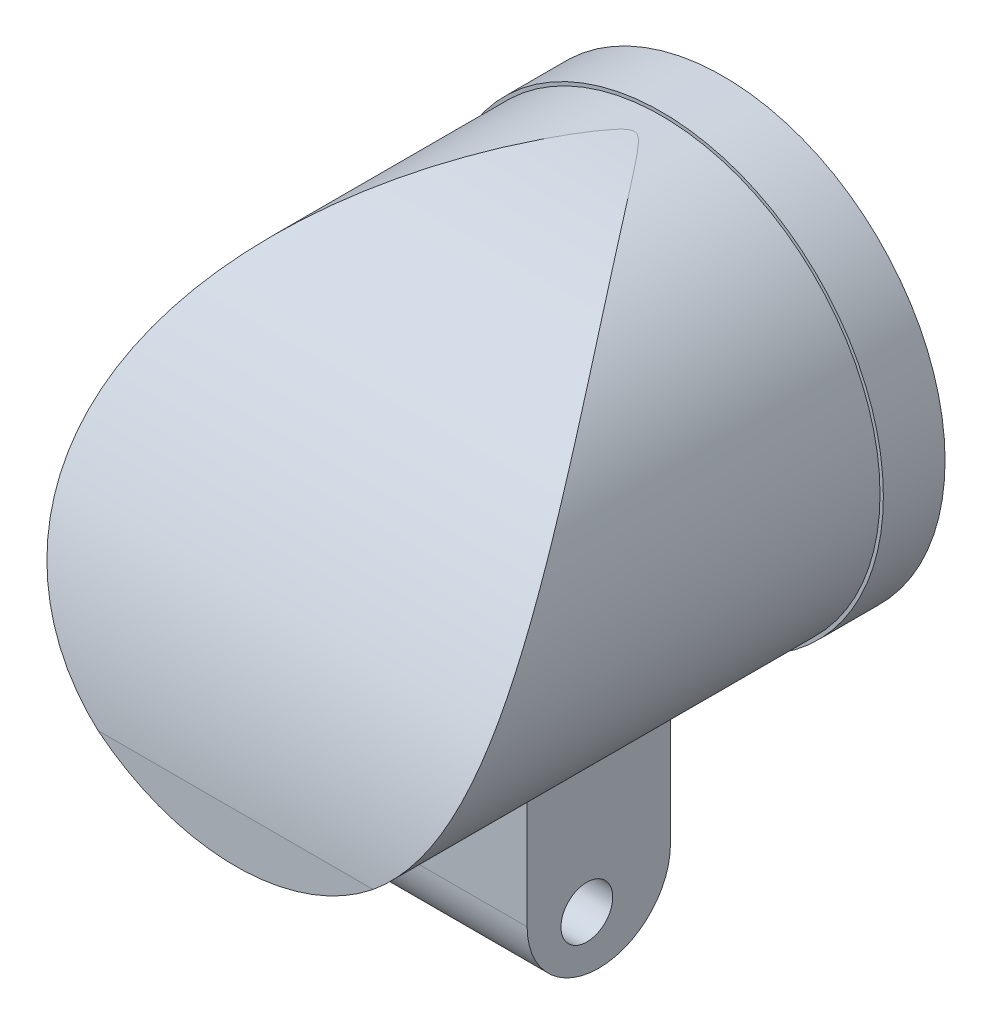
ISO-10303-21;
HEADER;
FILE_DESCRIPTION(('STEP AP214'),'2;1');
FILE_NAME('part.step','',(''),(''),'','','');
FILE_SCHEMA(('AUTOMOTIVE_DESIGN { 1 0 10303 214 1 1 1 1 }'));
ENDSEC;
DATA;
#1=APPLICATION_CONTEXT('core data for automotive mechanical design processes');
#2=APPLICATION_PROTOCOL_DEFINITION('international standard','automotive_design',2000,#1);
#3=PRODUCT_CONTEXT('',#1,'mechanical');
#4=PRODUCT('Part','Part','',(#3));
#5=PRODUCT_RELATED_PRODUCT_CATEGORY('part','',(#4));
#6=PRODUCT_DEFINITION_FORMATION('','',#4);
#7=PRODUCT_DEFINITION_CONTEXT('part definition',#1,'design');
#8=PRODUCT_DEFINITION('design','',#6,#7);
#9=PRODUCT_DEFINITION_SHAPE('','',#8);
#10=(LENGTH_UNIT() NAMED_UNIT(*) SI_UNIT(.MILLI.,.METRE.));
#11=(NAMED_UNIT(*) PLANE_ANGLE_UNIT() SI_UNIT($,.RADIAN.));
#12=(NAMED_UNIT(*) SI_UNIT($,.STERADIAN.) SOLID_ANGLE_UNIT());
#13=UNCERTAINTY_MEASURE_WITH_UNIT(LENGTH_MEASURE(1.E-05),#10,'distance_accuracy_value','');
#14=(GEOMETRIC_REPRESENTATION_CONTEXT(3) GLOBAL_UNCERTAINTY_ASSIGNED_CONTEXT((#13)) GLOBAL_UNIT_ASSIGNED_CONTEXT((#10,
#11,#12)) REPRESENTATION_CONTEXT('',''));
#15=CARTESIAN_POINT('',(0.,0.,0.));
#16=DIRECTION('',(0.,0.,1.));
#17=DIRECTION('',(1.,0.,0.));
#18=AXIS2_PLACEMENT_3D('',#15,#16,#17);
#19=CARTESIAN_POINT('',(12.319,-24.765,37.338));
#20=DIRECTION('',(0.,0.,1.));
#21=DIRECTION('',(1.,0.,0.));
#22=AXIS2_PLACEMENT_3D('',#19,#20,#21);
#23=PLANE('',#22);
#24=DIRECTION('',(0.,-1.,0.));
#25=VECTOR('',#24,1.);
#26=CARTESIAN_POINT('',(-12.319,-24.765,37.338));
#27=LINE('',#26,#25);
#28=CARTESIAN_POINT('',(-12.319,-24.765,37.338));
#29=VERTEX_POINT('',#28);
#30=CARTESIAN_POINT('',(-12.319,-40.8800612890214,37.338));
#31=VERTEX_POINT('',#30);
#32=EDGE_CURVE('E12',#29,#31,#27,.T.);
#33=ORIENTED_EDGE('',*,*,#32,.T.);
#34=DIRECTION('',(-1.,0.,0.));
#35=VECTOR('',#34,1.);
#36=CARTESIAN_POINT('',(28.321,-40.8800612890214,37.338));
#37=LINE('',#36,#35);
#38=CARTESIAN_POINT('',(12.319,-40.8800612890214,37.338));
#39=VERTEX_POINT('',#38);
#40=EDGE_CURVE('E82',#39,#31,#37,.T.);
#41=ORIENTED_EDGE('',*,*,#40,.F.);
#42=DIRECTION('',(0.,-1.,0.));
#43=VECTOR('',#42,1.);
#44=CARTESIAN_POINT('',(12.319,-24.765,37.338));
#45=LINE('',#44,#43);
#46=CARTESIAN_POINT('',(12.319,-24.765,37.338));
#47=VERTEX_POINT('',#46);
#48=EDGE_CURVE('E51',#47,#39,#45,.T.);
#49=ORIENTED_EDGE('',*,*,#48,.F.);
#50=DIRECTION('',(-1.,0.,0.));
#51=VECTOR('',#50,1.);
#52=CARTESIAN_POINT('',(12.319,-24.765,37.338));
#53=LINE('',#52,#51);
#54=EDGE_CURVE('E96',#47,#29,#53,.T.);
#55=ORIENTED_EDGE('',*,*,#54,.T.);
#56=EDGE_LOOP('',(#33,#41,#49,#55));
#57=FACE_BOUND('',#56,.T.);
#58=ADVANCED_FACE('F42',(#57),#23,.T.);
#59=CARTESIAN_POINT('',(-12.319,-24.765,37.338));
#60=DIRECTION('',(-1.,0.,0.));
#61=DIRECTION('',(0.,0.,1.));
#62=AXIS2_PLACEMENT_3D('',#59,#60,#61);
#63=PLANE('',#62);
#64=CARTESIAN_POINT('',(-12.319,-40.8800612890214,28.194));
#65=DIRECTION('',(1.,0.,0.));
#66=DIRECTION('',(0.,0.,-1.));
#67=AXIS2_PLACEMENT_3D('',#64,#65,#66);
#68=CIRCLE('',#67,9.144);
#69=CARTESIAN_POINT('',(-12.319,-40.8800612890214,19.05));
#70=VERTEX_POINT('',#69);
#71=EDGE_CURVE('E59',#31,#70,#68,.T.);
#72=ORIENTED_EDGE('',*,*,#71,.F.);
#73=ORIENTED_EDGE('',*,*,#32,.F.);
#74=DIRECTION('',(0.,0.,-1.));
#75=VECTOR('',#74,1.);
#76=CARTESIAN_POINT('',(-12.319,-24.765,37.338));
#77=LINE('',#76,#75);
#78=CARTESIAN_POINT('',(-12.319,-24.765,19.05));
#79=VERTEX_POINT('',#78);
#80=EDGE_CURVE('E117',#29,#79,#77,.T.);
#81=ORIENTED_EDGE('',*,*,#80,.T.);
#82=DIRECTION('',(0.,-1.,0.));
#83=VECTOR('',#82,1.);
#84=CARTESIAN_POINT('',(-12.319,-24.765,19.05));
#85=LINE('',#84,#83);
#86=EDGE_CURVE('E92',#79,#70,#85,.T.);
#87=ORIENTED_EDGE('',*,*,#86,.T.);
#88=EDGE_LOOP('',(#72,#73,#81,#87));
#89=FACE_BOUND('',#88,.T.);
#90=CARTESIAN_POINT('',(-12.319,-43.053,29.718));
#91=DIRECTION('',(-1.,0.,0.));
#92=DIRECTION('',(0.,0.,1.));
#93=AXIS2_PLACEMENT_3D('',#90,#91,#92);
#94=CIRCLE('',#93,3.302);
#95=CARTESIAN_POINT('',(-12.319,-43.053,33.02));
#96=VERTEX_POINT('',#95);
#97=EDGE_CURVE('E120',#96,#96,#94,.T.);
#98=ORIENTED_EDGE('',*,*,#97,.F.);
#99=EDGE_LOOP('',(#98));
#100=FACE_BOUND('',#99,.T.);
#101=ADVANCED_FACE('F44',(#89,#100),#63,.T.);
#102=CARTESIAN_POINT('',(12.319,-24.765,37.338));
#103=DIRECTION('',(1.,0.,0.));
#104=DIRECTION('',(0.,0.,-1.));
#105=AXIS2_PLACEMENT_3D('',#102,#103,#104);
#106=PLANE('',#105);
#107=CARTESIAN_POINT('',(12.319,-40.8800612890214,28.194));
#108=DIRECTION('',(1.,0.,0.));
#109=DIRECTION('',(0.,0.,-1.));
#110=AXIS2_PLACEMENT_3D('',#107,#108,#109);
#111=CIRCLE('',#110,9.144);
#112=CARTESIAN_POINT('',(12.319,-40.8800612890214,19.05));
#113=VERTEX_POINT('',#112);
#114=EDGE_CURVE('E85',#113,#39,#111,.F.);
#115=ORIENTED_EDGE('',*,*,#114,.F.);
#116=DIRECTION('',(0.,-1.,0.));
#117=VECTOR('',#116,1.);
#118=CARTESIAN_POINT('',(12.319,-24.765,19.05));
#119=LINE('',#118,#117);
#120=CARTESIAN_POINT('',(12.319,-24.765,19.05));
#121=VERTEX_POINT('',#120);
#122=EDGE_CURVE('E102',#121,#113,#119,.T.);
#123=ORIENTED_EDGE('',*,*,#122,.F.);
#124=DIRECTION('',(0.,0.,1.));
#125=VECTOR('',#124,1.);
#126=CARTESIAN_POINT('',(12.319,-24.765,37.338));
#127=LINE('',#126,#125);
#128=EDGE_CURVE('E100',#121,#47,#127,.T.);
#129=ORIENTED_EDGE('',*,*,#128,.T.);
#130=ORIENTED_EDGE('',*,*,#48,.T.);
#131=EDGE_LOOP('',(#115,#123,#129,#130));
#132=FACE_BOUND('',#131,.T.);
#133=CARTESIAN_POINT('',(12.319,-43.053,29.718));
#134=DIRECTION('',(1.,0.,0.));
#135=DIRECTION('',(0.,0.,-1.));
#136=AXIS2_PLACEMENT_3D('',#133,#134,#135);
#137=CIRCLE('',#136,3.302);
#138=CARTESIAN_POINT('',(12.319,-43.053,26.416));
#139=VERTEX_POINT('',#138);
#140=EDGE_CURVE('E46',#139,#139,#137,.T.);
#141=ORIENTED_EDGE('',*,*,#140,.F.);
#142=EDGE_LOOP('',(#141));
#143=FACE_BOUND('',#142,.T.);
#144=ADVANCED_FACE('F114',(#132,#143),#106,.T.);
#145=CARTESIAN_POINT('',(12.319,-24.765,19.05));
#146=DIRECTION('',(0.,0.,-1.));
#147=DIRECTION('',(-1.,0.,0.));
#148=AXIS2_PLACEMENT_3D('',#145,#146,#147);
#149=PLANE('',#148);
#150=DIRECTION('',(-1.,0.,0.));
#151=VECTOR('',#150,1.);
#152=CARTESIAN_POINT('',(28.321,-40.8800612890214,19.05));
#153=LINE('',#152,#151);
#154=EDGE_CURVE('E88',#113,#70,#153,.T.);
#155=ORIENTED_EDGE('',*,*,#154,.T.);
#156=ORIENTED_EDGE('',*,*,#86,.F.);
#157=DIRECTION('',(1.,0.,0.));
#158=VECTOR('',#157,1.);
#159=CARTESIAN_POINT('',(12.319,-24.765,19.05));
#160=LINE('',#159,#158);
#161=EDGE_CURVE('E103',#79,#121,#160,.T.);
#162=ORIENTED_EDGE('',*,*,#161,.T.);
#163=ORIENTED_EDGE('',*,*,#122,.T.);
#164=EDGE_LOOP('',(#155,#156,#162,#163));
#165=FACE_BOUND('',#164,.T.);
#166=ADVANCED_FACE('F111',(#165),#149,.T.);
#167=CARTESIAN_POINT('',(0.,-24.765,0.));
#168=DIRECTION('',(0.,1.,0.));
#169=DIRECTION('',(0.,0.,1.));
#170=AXIS2_PLACEMENT_3D('',#167,#168,#169);
#171=PLANE('',#170);
#172=ORIENTED_EDGE('',*,*,#80,.F.);
#173=ORIENTED_EDGE('',*,*,#54,.F.);
#174=ORIENTED_EDGE('',*,*,#128,.F.);
#175=ORIENTED_EDGE('',*,*,#161,.F.);
#176=EDGE_LOOP('',(#172,#173,#174,#175));
#177=FACE_BOUND('',#176,.T.);
#178=ADVANCED_FACE('F116',(#177),#171,.T.);
#179=CARTESIAN_POINT('',(28.321,-43.053,29.718));
#180=DIRECTION('',(-1.,0.,0.));
#181=DIRECTION('',(0.,0.,1.));
#182=AXIS2_PLACEMENT_3D('',#179,#180,#181);
#183=CYLINDRICAL_SURFACE('',#182,3.302);
#184=ORIENTED_EDGE('',*,*,#140,.T.);
#185=EDGE_LOOP('',(#184));
#186=FACE_BOUND('',#185,.T.);
#187=ORIENTED_EDGE('',*,*,#97,.T.);
#188=EDGE_LOOP('',(#187));
#189=FACE_BOUND('',#188,.T.);
#190=ADVANCED_FACE('F127',(#186,#189),#183,.F.);
#191=CARTESIAN_POINT('',(28.321,-40.8800612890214,28.194));
#192=DIRECTION('',(-1.,0.,0.));
#193=DIRECTION('',(0.,0.,1.));
#194=AXIS2_PLACEMENT_3D('',#191,#192,#193);
#195=CYLINDRICAL_SURFACE('',#194,9.144);
#196=ORIENTED_EDGE('',*,*,#114,.T.);
#197=ORIENTED_EDGE('',*,*,#40,.T.);
#198=ORIENTED_EDGE('',*,*,#71,.T.);
#199=ORIENTED_EDGE('',*,*,#154,.F.);
#200=EDGE_LOOP('',(#196,#197,#198,#199));
#201=FACE_BOUND('',#200,.T.);
#202=ADVANCED_FACE('F83',(#201),#195,.T.);
#203=CLOSED_SHELL('',(#58,#101,#144,#166,#178,#190,#202));
#204=MANIFOLD_SOLID_BREP('B2',#203);
#205=CARTESIAN_POINT('',(0.,0.,62.23));
#206=DIRECTION('',(0.,0.,-1.));
#207=DIRECTION('',(-1.,0.,0.));
#208=AXIS2_PLACEMENT_3D('',#205,#206,#207);
#209=CYLINDRICAL_SURFACE('',#208,27.8935945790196);
#210=CARTESIAN_POINT('',(0.,0.,7.874));
#211=DIRECTION('',(0.,0.,1.));
#212=DIRECTION('',(1.,0.,0.));
#213=AXIS2_PLACEMENT_3D('',#210,#211,#212);
#214=CIRCLE('',#213,27.8935945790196);
#215=CARTESIAN_POINT('',(27.8935945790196,0.,7.874));
#216=VERTEX_POINT('',#215);
#217=EDGE_CURVE('E239',#216,#216,#214,.T.);
#218=ORIENTED_EDGE('',*,*,#217,.T.);
#219=EDGE_LOOP('',(#218));
#220=FACE_BOUND('',#219,.T.);
#221=CARTESIAN_POINT('',(17.5555889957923,-21.6761138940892,62.23));
#222=CARTESIAN_POINT('',(17.8407198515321,-21.4451858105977,62.2163545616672));
#223=CARTESIAN_POINT('',(18.1212083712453,-21.2086980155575,62.2008572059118));
#224=CARTESIAN_POINT('',(18.6725063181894,-20.7249762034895,62.1657259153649));
#225=CARTESIAN_POINT('',(18.9433154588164,-20.4777418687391,62.1460918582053));
#226=CARTESIAN_POINT('',(19.7405927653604,-19.7205136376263,62.0803380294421));
#227=CARTESIAN_POINT('',(20.2519263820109,-19.1949819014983,62.0273659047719));
#228=CARTESIAN_POINT('',(21.2302254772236,-18.1070495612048,61.8998881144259));
#229=CARTESIAN_POINT('',(21.6972094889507,-17.5446645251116,61.8253914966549));
#230=CARTESIAN_POINT('',(22.5839671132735,-16.3874422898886,61.6518007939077));
#231=CARTESIAN_POINT('',(23.0037453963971,-15.7926083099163,61.5527091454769));
#232=CARTESIAN_POINT('',(23.7942967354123,-14.5743758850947,61.3270284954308));
#233=CARTESIAN_POINT('',(24.1649659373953,-13.9509205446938,61.2003826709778));
#234=CARTESIAN_POINT('',(24.8542497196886,-12.6822724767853,60.9175676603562));
#235=CARTESIAN_POINT('',(25.1728626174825,-12.0370790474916,60.7613975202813));
#236=CARTESIAN_POINT('',(25.7564663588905,-10.731625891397,60.4182072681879));
#237=CARTESIAN_POINT('',(26.0215077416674,-10.0713810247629,60.231216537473));
#238=CARTESIAN_POINT('',(26.4979214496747,-8.74138144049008,59.8255058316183));
#239=CARTESIAN_POINT('',(26.7092949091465,-8.07162692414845,59.6067865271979));
#240=CARTESIAN_POINT('',(27.0751649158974,-6.74196628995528,59.1422197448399));
#241=CARTESIAN_POINT('',(27.2307072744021,-6.08212861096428,58.8969970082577));
#242=CARTESIAN_POINT('',(27.4918849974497,-4.76445468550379,58.3765755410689));
#243=CARTESIAN_POINT('',(27.5975210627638,-4.10661841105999,58.1013772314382));
#244=CARTESIAN_POINT('',(27.7608086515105,-2.79742428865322,57.5219129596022));
#245=CARTESIAN_POINT('',(27.8184325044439,-2.14607038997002,57.2176303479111));
#246=CARTESIAN_POINT('',(27.8880061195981,-0.854457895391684,56.5816039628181));
#247=CARTESIAN_POINT('',(27.8999536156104,-0.214199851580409,56.2498588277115));
#248=CARTESIAN_POINT('',(27.880242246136,1.09875903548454,55.5349999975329));
#249=CARTESIAN_POINT('',(27.845271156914,1.77032710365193,55.1499007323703));
#250=CARTESIAN_POINT('',(27.729537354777,3.09291595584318,54.3524091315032));
#251=CARTESIAN_POINT('',(27.6487736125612,3.74393627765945,53.9400161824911));
#252=CARTESIAN_POINT('',(27.4452801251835,5.02280296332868,53.0903217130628));
#253=CARTESIAN_POINT('',(27.3225440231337,5.6506458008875,52.6530164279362));
#254=CARTESIAN_POINT('',(27.0388631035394,6.88122913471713,51.7558447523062));
#255=CARTESIAN_POINT('',(26.8779098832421,7.48396407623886,51.2959734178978));
#256=CARTESIAN_POINT('',(26.5609157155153,8.53230767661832,50.4601235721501));
#257=CARTESIAN_POINT('',(26.4116734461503,8.98316478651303,50.0881071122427));
#258=CARTESIAN_POINT('',(26.0938910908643,9.8682586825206,49.3329303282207));
#259=CARTESIAN_POINT('',(25.9253540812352,10.3024981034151,48.9497717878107));
#260=CARTESIAN_POINT('',(25.3929092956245,11.5803596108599,47.7845586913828));
#261=CARTESIAN_POINT('',(25.002239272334,12.3988932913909,46.9869520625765));
#262=CARTESIAN_POINT('',(24.1599136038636,13.9695197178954,45.3557546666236));
#263=CARTESIAN_POINT('',(23.7081182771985,14.7214535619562,44.5220845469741));
#264=CARTESIAN_POINT('',(22.7536883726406,16.1575198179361,42.8260811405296));
#265=CARTESIAN_POINT('',(22.2510547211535,16.8416534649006,41.9637483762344));
#266=CARTESIAN_POINT('',(21.3573355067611,17.9517260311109,40.4727039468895));
#267=CARTESIAN_POINT('',(20.976947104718,18.3944038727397,39.8499136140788));
#268=CARTESIAN_POINT('',(20.1972860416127,19.2472352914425,38.5938629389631));
#269=CARTESIAN_POINT('',(19.7980117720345,19.657386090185,37.9606017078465));
#270=CARTESIAN_POINT('',(18.9826537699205,20.4458613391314,36.6847221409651));
#271=CARTESIAN_POINT('',(18.5665632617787,20.8241727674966,36.0421001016));
#272=CARTESIAN_POINT('',(17.7197051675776,21.5493708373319,34.7489537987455));
#273=CARTESIAN_POINT('',(17.2889379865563,21.8962583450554,34.0984297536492));
#274=CARTESIAN_POINT('',(15.9774249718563,22.8905779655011,32.1367990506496));
#275=CARTESIAN_POINT('',(15.077155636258,23.4919653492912,30.8151482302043));
#276=CARTESIAN_POINT('',(13.2370640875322,24.5758558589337,28.1519549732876));
#277=CARTESIAN_POINT('',(12.2972565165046,25.0584025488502,26.8104200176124));
#278=CARTESIAN_POINT('',(10.8651335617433,25.6957944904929,24.7885876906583));
#279=CARTESIAN_POINT('',(10.3843063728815,25.8937649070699,24.113445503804));
#280=CARTESIAN_POINT('',(9.4158002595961,26.2614481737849,22.7604700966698));
#281=CARTESIAN_POINT('',(8.92812215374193,26.4311643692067,22.0826372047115));
#282=CARTESIAN_POINT('',(7.94719125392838,26.7424594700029,20.7261777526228));
#283=CARTESIAN_POINT('',(7.45394793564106,26.8840802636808,20.0475539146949));
#284=CARTESIAN_POINT('',(6.46125870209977,27.1397801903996,18.6896870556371));
#285=CARTESIAN_POINT('',(5.96181310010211,27.2538607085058,18.0104440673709));
#286=CARTESIAN_POINT('',(5.13268583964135,27.419308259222,16.8927009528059));
#287=CARTESIAN_POINT('',(4.80520783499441,27.4786079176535,16.4537211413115));
#288=CARTESIAN_POINT('',(4.14561609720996,27.5858381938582,15.5772711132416));
#289=CARTESIAN_POINT('',(3.81349885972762,27.6337596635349,15.1398023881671));
#290=CARTESIAN_POINT('',(3.27536894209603,27.7013715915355,14.4430106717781));
#291=CARTESIAN_POINT('',(3.07181619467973,27.7247041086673,14.1821327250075));
#292=CARTESIAN_POINT('',(2.66062771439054,27.76718323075,13.6641378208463));
#293=CARTESIAN_POINT('',(2.45300189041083,27.7863388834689,13.4070138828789));
#294=CARTESIAN_POINT('',(2.112147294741,27.8138125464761,12.9987703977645));
#295=CARTESIAN_POINT('',(1.98156857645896,27.82343966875,12.8455095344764));
#296=CARTESIAN_POINT('',(1.71440753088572,27.8411831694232,12.5423184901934));
#297=CARTESIAN_POINT('',(1.57779324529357,27.8492899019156,12.3924145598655));
#298=CARTESIAN_POINT('',(1.29400922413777,27.8639332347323,12.0996401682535));
#299=CARTESIAN_POINT('',(1.14672829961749,27.8704487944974,11.9568819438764));
#300=CARTESIAN_POINT('',(0.83437560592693,27.8815529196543,11.691688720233));
#301=CARTESIAN_POINT('',(0.669525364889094,27.8861625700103,11.5690409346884));
#302=CARTESIAN_POINT('',(0.421617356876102,27.8904821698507,11.4472394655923));
#303=CARTESIAN_POINT('',(0.353754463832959,27.8914396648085,11.4192911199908));
#304=CARTESIAN_POINT('',(0.214032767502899,27.8928600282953,11.3773363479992));
#305=CARTESIAN_POINT('',(0.142203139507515,27.8933261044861,11.3632395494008));
#306=CARTESIAN_POINT('',(0.0131474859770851,27.893648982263,11.3534834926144));
#307=CARTESIAN_POINT('',(-0.0438238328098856,27.8936170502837,11.3544567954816));
#308=CARTESIAN_POINT('',(-0.156715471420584,27.8932116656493,11.3666851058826));
#309=CARTESIAN_POINT('',(-0.212633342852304,27.8928374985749,11.3779616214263));
#310=CARTESIAN_POINT('',(-0.342721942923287,27.8915912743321,11.4148551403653));
#311=CARTESIAN_POINT('',(-0.415772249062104,27.8905842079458,11.4442888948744));
#312=CARTESIAN_POINT('',(-0.556717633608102,27.8881280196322,11.5136920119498));
#313=CARTESIAN_POINT('',(-0.624589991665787,27.8866770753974,11.5537047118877));
#314=CARTESIAN_POINT('',(-0.826404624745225,27.8816848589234,11.6862783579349));
#315=CARTESIAN_POINT('',(-0.953298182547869,27.8775685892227,11.7892401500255));
#316=CARTESIAN_POINT('',(-1.19717384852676,27.8681571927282,12.0064394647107));
#317=CARTESIAN_POINT('',(-1.31410692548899,27.8628566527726,12.1207273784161));
#318=CARTESIAN_POINT('',(-1.54308195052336,27.8511177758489,12.3562758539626));
#319=CARTESIAN_POINT('',(-1.65506436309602,27.844668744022,12.4775940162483));
#320=CARTESIAN_POINT('',(-1.87489294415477,27.8307286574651,12.7232811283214));
#321=CARTESIAN_POINT('',(-1.98274824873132,27.8232400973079,12.8476422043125));
#322=CARTESIAN_POINT('',(-2.29821254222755,27.7995474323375,13.21867987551));
#323=CARTESIAN_POINT('',(-2.50227882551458,27.7818729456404,13.4682693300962));
#324=CARTESIAN_POINT('',(-2.90548639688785,27.742595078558,13.9711039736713));
#325=CARTESIAN_POINT('',(-3.1046267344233,27.720990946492,14.2243498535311));
#326=CARTESIAN_POINT('',(-3.69808229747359,27.6502455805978,14.9876232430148));
#327=CARTESIAN_POINT('',(-4.08793939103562,27.5952094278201,15.5005807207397));
#328=CARTESIAN_POINT('',(-4.85912615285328,27.4698476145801,16.5254173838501));
#329=CARTESIAN_POINT('',(-5.2404959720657,27.3996294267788,17.0372798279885));
#330=CARTESIAN_POINT('',(-5.9988538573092,27.2436454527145,18.0615714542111));
#331=CARTESIAN_POINT('',(-6.37584353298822,27.15788558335,18.5740003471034));
#332=CARTESIAN_POINT('',(-7.34680471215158,26.9156855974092,19.8998238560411));
#333=CARTESIAN_POINT('',(-7.93805638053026,26.7473315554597,20.7130661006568));
#334=CARTESIAN_POINT('',(-9.11159109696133,26.3706502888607,22.3368978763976));
#335=CARTESIAN_POINT('',(-9.69387306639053,26.1623182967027,23.1474870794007));
#336=CARTESIAN_POINT('',(-10.8487849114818,25.7049129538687,24.7651065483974));
#337=CARTESIAN_POINT('',(-11.4214065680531,25.4558066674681,25.5721333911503));
#338=CARTESIAN_POINT('',(-12.5548958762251,24.9162827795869,27.1805824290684));
#339=CARTESIAN_POINT('',(-13.115764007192,24.6258668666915,27.9820048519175));
#340=CARTESIAN_POINT('',(-14.2250807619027,24.0021979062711,29.5797622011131));
#341=CARTESIAN_POINT('',(-14.7734981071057,23.668848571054,30.3760813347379));
#342=CARTESIAN_POINT('',(-15.8543124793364,22.9589081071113,31.9603726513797));
#343=CARTESIAN_POINT('',(-16.3867087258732,22.5823148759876,32.7483444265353));
#344=CARTESIAN_POINT('',(-17.4324309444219,21.7851987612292,34.3137442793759));
#345=CARTESIAN_POINT('',(-17.9457704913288,21.3647079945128,35.0911796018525));
#346=CARTESIAN_POINT('',(-18.9506670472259,20.47861131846,36.6341592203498));
#347=CARTESIAN_POINT('',(-19.4422272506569,20.0130120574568,37.399705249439));
#348=CARTESIAN_POINT('',(-20.4847577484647,18.9492896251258,39.0509424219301));
#349=CARTESIAN_POINT('',(-21.0309020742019,18.3422800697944,39.9339924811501));
#350=CARTESIAN_POINT('',(-22.0817231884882,17.06269157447,41.6770037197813));
#351=CARTESIAN_POINT('',(-22.5864028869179,16.3901172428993,42.5369665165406));
#352=CARTESIAN_POINT('',(-23.5456904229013,14.979301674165,44.2277178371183));
#353=CARTESIAN_POINT('',(-24.0003850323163,14.2411783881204,45.0585551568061));
#354=CARTESIAN_POINT('',(-24.8515264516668,12.6976638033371,46.6870217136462));
#355=CARTESIAN_POINT('',(-25.2479841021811,11.8922850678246,47.4846571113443));
#356=CARTESIAN_POINT('',(-25.9023279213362,10.3762345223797,48.8905076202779));
#357=CARTESIAN_POINT('',(-26.1721996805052,9.67714807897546,49.5056439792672));
#358=CARTESIAN_POINT('',(-26.6606508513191,8.23654441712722,50.7061008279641));
#359=CARTESIAN_POINT('',(-26.879231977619,7.49502861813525,51.2914223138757));
#360=CARTESIAN_POINT('',(-27.2580195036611,5.97228278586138,52.4275141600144));
#361=CARTESIAN_POINT('',(-27.4182613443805,5.19107719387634,52.9783053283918));
#362=CARTESIAN_POINT('',(-27.673143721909,3.59229130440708,54.0409815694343));
#363=CARTESIAN_POINT('',(-27.7677978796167,2.77471859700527,54.5528747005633));
#364=CARTESIAN_POINT('',(-27.8730276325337,1.26682114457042,55.4400183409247));
#365=CARTESIAN_POINT('',(-27.8961446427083,0.581770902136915,55.8227713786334));
#366=CARTESIAN_POINT('',(-27.8905994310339,-0.804615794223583,56.5572053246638));
#367=CARTESIAN_POINT('',(-27.8619428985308,-1.50595045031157,56.9088896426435));
#368=CARTESIAN_POINT('',(-27.7494518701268,-2.9193457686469,57.5787056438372));
#369=CARTESIAN_POINT('',(-27.6656717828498,-3.63139517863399,57.8968700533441));
#370=CARTESIAN_POINT('',(-27.4401445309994,-5.06110058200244,58.4983375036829));
#371=CARTESIAN_POINT('',(-27.2983967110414,-5.77875663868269,58.7816401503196));
#372=CARTESIAN_POINT('',(-26.9541205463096,-7.21642926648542,59.3135479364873));
#373=CARTESIAN_POINT('',(-26.7513102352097,-7.93644112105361,59.5619840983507));
#374=CARTESIAN_POINT('',(-26.2841524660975,-9.36818745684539,60.02230388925));
#375=CARTESIAN_POINT('',(-26.0198041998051,-10.0799218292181,60.234187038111));
#376=CARTESIAN_POINT('',(-25.4294079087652,-11.4883198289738,60.622257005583));
#377=CARTESIAN_POINT('',(-25.103294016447,-12.1849664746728,60.7984052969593));
#378=CARTESIAN_POINT('',(-24.3908515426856,-13.5548864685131,61.1163180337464));
#379=CARTESIAN_POINT('',(-24.0045262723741,-14.2281610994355,61.2580843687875));
#380=CARTESIAN_POINT('',(-23.1868633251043,-15.5238772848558,61.5058390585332));
#381=CARTESIAN_POINT('',(-22.7572854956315,-16.1472467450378,61.6127976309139));
#382=CARTESIAN_POINT('',(-21.8465489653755,-17.3595947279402,61.7997157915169));
#383=CARTESIAN_POINT('',(-21.3653860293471,-17.9485704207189,61.879673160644));
#384=CARTESIAN_POINT('',(-20.6076448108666,-18.8022003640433,61.9819067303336));
#385=CARTESIAN_POINT('',(-20.3489449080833,-19.0818862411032,62.013043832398));
#386=CARTESIAN_POINT('',(-19.8199934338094,-19.630732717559,62.0698733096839));
#387=CARTESIAN_POINT('',(-19.5497417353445,-19.8998932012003,62.0955656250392));
#388=CARTESIAN_POINT('',(-18.9982570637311,-20.4270489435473,62.1419656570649));
#389=CARTESIAN_POINT('',(-18.7170261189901,-20.6850462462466,62.1626742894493));
#390=CARTESIAN_POINT('',(-18.1440594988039,-21.1894190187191,62.1995917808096));
#391=CARTESIAN_POINT('',(-17.8523241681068,-21.4357948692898,62.2158007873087));
#392=CARTESIAN_POINT('',(-17.5555889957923,-21.6761138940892,62.23));
#393=B_SPLINE_CURVE_WITH_KNOTS('',3,(#221,#222,#223,#224,#225,#226,#227,#228,#229,#230,#231,
#232,#233,#234,#235,#236,#237,#238,#239,#240,#241,#242,#243,#244,#245,#246,#247,#248,#249,#250,
#251,#252,#253,#254,#255,#256,#257,#258,#259,#260,#261,#262,#263,#264,#265,#266,#267,#268,#269,
#270,#271,#272,#273,#274,#275,#276,#277,#278,#279,#280,#281,#282,#283,#284,#285,#286,#287,#288,
#289,#290,#291,#292,#293,#294,#295,#296,#297,#298,#299,#300,#301,#302,#303,#304,#305,#306,#307,
#308,#309,#310,#311,#312,#313,#314,#315,#316,#317,#318,#319,#320,#321,#322,#323,#324,#325,#326,
#327,#328,#329,#330,#331,#332,#333,#334,#335,#336,#337,#338,#339,#340,#341,#342,#343,#344,#345,
#346,#347,#348,#349,#350,#351,#352,#353,#354,#355,#356,#357,#358,#359,#360,#361,#362,#363,#364,
#365,#366,#367,#368,#369,#370,#371,#372,#373,#374,#375,#376,#377,#378,#379,#380,#381,#382,#383,
#384,#385,#386,#387,#388,#389,#390,#391,#392),.UNSPECIFIED.,.F.,.F.,(4,2,2,2,2,2,2,2,2,2,2,2,2,
2,2,2,2,2,2,2,2,2,2,2,2,2,2,2,2,2,2,2,2,2,2,2,2,2,2,2,2,2,2,2,2,2,2,2,2,2,2,2,2,2,2,2,2,2,2,2,2,
2,2,2,2,2,2,2,2,2,2,2,2,2,2,2,2,2,2,2,2,2,2,2,2,4),(0.,1.10135176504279,2.20273611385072,
4.40544485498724,6.60722902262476,8.80879515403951,11.0149451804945,13.2211664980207,
15.425296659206,17.6293802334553,19.7897086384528,21.950006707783,24.11154894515,
26.2731984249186,28.5957592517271,30.9183722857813,33.2413372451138,35.5648134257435,
37.3739890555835,39.1828766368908,42.8015640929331,46.4286651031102,50.0557000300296,
52.6154676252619,55.1754536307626,57.7364815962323,60.2974389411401,65.4174104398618,
70.5355022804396,73.091615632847,75.6474261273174,78.1993969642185,80.7512394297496,
82.4037505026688,84.0575857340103,85.0527062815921,86.0456493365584,86.6503826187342,
87.2588315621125,87.8749366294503,88.4840305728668,88.7032129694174,88.9209556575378,
89.0909111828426,89.2612223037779,89.4961247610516,89.7320048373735,90.2203851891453,
90.71104527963,91.2065392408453,91.700864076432,92.6693110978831,93.6379435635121,
95.5775525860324,97.5038562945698,99.4294281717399,102.486923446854,105.544783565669,
108.60512599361,111.665343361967,114.732547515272,117.799900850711,120.865025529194,
123.92969913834,127.535251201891,131.14055002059,134.739487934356,138.33775506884,
141.24382158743,144.149790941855,147.053991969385,149.957589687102,152.310498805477,
154.663149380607,157.013481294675,159.363839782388,161.725222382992,164.086636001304,
166.450582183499,168.814398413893,171.10516939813,173.396128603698,174.54260317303,
175.689090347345,176.835366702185,177.98160547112),.UNSPECIFIED.);
#394=CARTESIAN_POINT('',(17.5555889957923,-21.6761138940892,62.23));
#395=VERTEX_POINT('',#394);
#396=CARTESIAN_POINT('',(-17.5555889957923,-21.6761138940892,62.23));
#397=VERTEX_POINT('',#396);
#398=EDGE_CURVE('E200',#395,#397,#393,.T.);
#399=ORIENTED_EDGE('',*,*,#398,.F.);
#400=CARTESIAN_POINT('',(0.,0.,62.23));
#401=DIRECTION('',(0.,0.,1.));
#402=DIRECTION('',(1.,0.,0.));
#403=AXIS2_PLACEMENT_3D('',#400,#401,#402);
#404=CIRCLE('',#403,27.8935945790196);
#405=EDGE_CURVE('E234',#397,#395,#404,.T.);
#406=ORIENTED_EDGE('',*,*,#405,.F.);
#407=EDGE_LOOP('',(#399,#406));
#408=FACE_BOUND('',#407,.T.);
#409=ADVANCED_FACE('F186',(#220,#408),#209,.T.);
#410=CARTESIAN_POINT('',(0.,0.,62.23));
#411=DIRECTION('',(0.,0.,1.));
#412=DIRECTION('',(1.,0.,0.));
#413=AXIS2_PLACEMENT_3D('',#410,#411,#412);
#414=PLANE('',#413);
#415=ORIENTED_EDGE('',*,*,#405,.T.);
#416=DIRECTION('',(1.,0.,0.));
#417=VECTOR('',#416,1.);
#418=CARTESIAN_POINT('',(-28.321,-21.6761138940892,62.23));
#419=LINE('',#418,#417);
#420=EDGE_CURVE('E40',#395,#397,#419,.F.);
#421=ORIENTED_EDGE('',*,*,#420,.T.);
#422=EDGE_LOOP('',(#415,#421));
#423=FACE_BOUND('',#422,.T.);
#424=ADVANCED_FACE('F237',(#423),#414,.T.);
#425=CARTESIAN_POINT('',(0.,0.,7.874));
#426=DIRECTION('',(0.,0.,1.));
#427=DIRECTION('',(1.,0.,0.));
#428=AXIS2_PLACEMENT_3D('',#425,#426,#427);
#429=PLANE('',#428);
#430=CARTESIAN_POINT('',(0.,0.,7.874));
#431=DIRECTION('',(0.,0.,1.));
#432=DIRECTION('',(1.,0.,0.));
#433=AXIS2_PLACEMENT_3D('',#430,#431,#432);
#434=CIRCLE('',#433,28.321);
#435=CARTESIAN_POINT('',(28.321,0.,7.874));
#436=VERTEX_POINT('',#435);
#437=EDGE_CURVE('E253',#436,#436,#434,.T.);
#438=ORIENTED_EDGE('',*,*,#437,.T.);
#439=EDGE_LOOP('',(#438));
#440=FACE_BOUND('',#439,.T.);
#441=ORIENTED_EDGE('',*,*,#217,.F.);
#442=EDGE_LOOP('',(#441));
#443=FACE_BOUND('',#442,.T.);
#444=ADVANCED_FACE('F310',(#440,#443),#429,.T.);
#445=CARTESIAN_POINT('',(0.,0.,7.874));
#446=DIRECTION('',(0.,0.,-1.));
#447=DIRECTION('',(-1.,0.,0.));
#448=AXIS2_PLACEMENT_3D('',#445,#446,#447);
#449=CYLINDRICAL_SURFACE('',#448,28.321);
#450=ORIENTED_EDGE('',*,*,#437,.F.);
#451=EDGE_LOOP('',(#450));
#452=FACE_BOUND('',#451,.T.);
#453=CARTESIAN_POINT('',(0.,0.,6.35));
#454=DIRECTION('',(0.,0.,1.));
#455=DIRECTION('',(1.,0.,0.));
#456=AXIS2_PLACEMENT_3D('',#453,#454,#455);
#457=CIRCLE('',#456,28.321);
#458=CARTESIAN_POINT('',(-1.27000000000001,-28.2925103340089,6.35));
#459=VERTEX_POINT('',#458);
#460=CARTESIAN_POINT('',(1.27,-28.2925103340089,6.35));
#461=VERTEX_POINT('',#460);
#462=EDGE_CURVE('E194',#459,#461,#457,.T.);
#463=ORIENTED_EDGE('',*,*,#462,.T.);
#464=DIRECTION('',(0.,0.,-1.));
#465=VECTOR('',#464,1.);
#466=CARTESIAN_POINT('',(1.27,-28.2925103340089,7.874));
#467=LINE('',#466,#465);
#468=CARTESIAN_POINT('',(1.27,-28.2925103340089,0.));
#469=VERTEX_POINT('',#468);
#470=EDGE_CURVE('E245',#461,#469,#467,.T.);
#471=ORIENTED_EDGE('',*,*,#470,.T.);
#472=CARTESIAN_POINT('',(0.,0.,0.));
#473=DIRECTION('',(0.,0.,1.));
#474=DIRECTION('',(1.,0.,0.));
#475=AXIS2_PLACEMENT_3D('',#472,#473,#474);
#476=CIRCLE('',#475,28.321);
#477=CARTESIAN_POINT('',(-1.27000000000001,-28.2925103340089,0.));
#478=VERTEX_POINT('',#477);
#479=EDGE_CURVE('E251',#469,#478,#476,.T.);
#480=ORIENTED_EDGE('',*,*,#479,.T.);
#481=DIRECTION('',(0.,0.,-1.));
#482=VECTOR('',#481,1.);
#483=CARTESIAN_POINT('',(-1.27000000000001,-28.2925103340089,7.874));
#484=LINE('',#483,#482);
#485=EDGE_CURVE('E257',#478,#459,#484,.F.);
#486=ORIENTED_EDGE('',*,*,#485,.T.);
#487=EDGE_LOOP('',(#463,#471,#480,#486));
#488=FACE_BOUND('',#487,.T.);
#489=ADVANCED_FACE('F188',(#452,#488),#449,.T.);
#490=CARTESIAN_POINT('',(0.,0.,0.));
#491=DIRECTION('',(0.,0.,1.));
#492=DIRECTION('',(1.,0.,0.));
#493=AXIS2_PLACEMENT_3D('',#490,#491,#492);
#494=PLANE('',#493);
#495=CARTESIAN_POINT('',(0.,0.,0.));
#496=DIRECTION('',(0.,0.,-1.));
#497=DIRECTION('',(-1.,0.,0.));
#498=AXIS2_PLACEMENT_3D('',#495,#496,#497);
#499=CIRCLE('',#498,18.923);
#500=CARTESIAN_POINT('',(-18.923,0.,0.));
#501=VERTEX_POINT('',#500);
#502=EDGE_CURVE('E238',#501,#501,#499,.T.);
#503=ORIENTED_EDGE('',*,*,#502,.F.);
#504=EDGE_LOOP('',(#503));
#505=FACE_BOUND('',#504,.T.);
#506=ORIENTED_EDGE('',*,*,#479,.F.);
#507=DIRECTION('',(0.,-1.,0.));
#508=VECTOR('',#507,1.);
#509=CARTESIAN_POINT('',(1.27,-28.067,0.));
#510=LINE('',#509,#508);
#511=CARTESIAN_POINT('',(1.27,-28.575,0.));
#512=VERTEX_POINT('',#511);
#513=EDGE_CURVE('E235',#469,#512,#510,.T.);
#514=ORIENTED_EDGE('',*,*,#513,.T.);
#515=DIRECTION('',(-1.,0.,0.));
#516=VECTOR('',#515,1.);
#517=CARTESIAN_POINT('',(-1.27000000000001,-28.575,0.));
#518=LINE('',#517,#516);
#519=CARTESIAN_POINT('',(-1.27000000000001,-28.575,0.));
#520=VERTEX_POINT('',#519);
#521=EDGE_CURVE('E272',#512,#520,#518,.T.);
#522=ORIENTED_EDGE('',*,*,#521,.T.);
#523=DIRECTION('',(0.,1.,0.));
#524=VECTOR('',#523,1.);
#525=CARTESIAN_POINT('',(-1.27000000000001,-28.067,0.));
#526=LINE('',#525,#524);
#527=EDGE_CURVE('E265',#520,#478,#526,.T.);
#528=ORIENTED_EDGE('',*,*,#527,.T.);
#529=EDGE_LOOP('',(#506,#514,#522,#528));
#530=FACE_BOUND('',#529,.T.);
#531=ADVANCED_FACE('F270',(#505,#530),#494,.F.);
#532=CARTESIAN_POINT('',(0.,0.,2.9972));
#533=DIRECTION('',(0.,0.,-1.));
#534=DIRECTION('',(-1.,0.,0.));
#535=AXIS2_PLACEMENT_3D('',#532,#533,#534);
#536=CYLINDRICAL_SURFACE('',#535,18.923);
#537=CARTESIAN_POINT('',(0.,0.,2.9972));
#538=DIRECTION('',(0.,0.,-1.));
#539=DIRECTION('',(-1.,0.,0.));
#540=AXIS2_PLACEMENT_3D('',#537,#538,#539);
#541=CIRCLE('',#540,18.923);
#542=CARTESIAN_POINT('',(-18.923,0.,2.9972));
#543=VERTEX_POINT('',#542);
#544=EDGE_CURVE('E242',#543,#543,#541,.T.);
#545=CARTESIAN_POINT('',(-18.923,0.,2.9972));
#546=CARTESIAN_POINT('',(-18.923,0.,2.96597916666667));
#547=CARTESIAN_POINT('',(-18.923,0.,2.93475833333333));
#548=CARTESIAN_POINT('',(-18.923,0.,2.87231666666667));
#549=CARTESIAN_POINT('',(-18.923,0.,2.84109583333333));
#550=CARTESIAN_POINT('',(-18.923,0.,2.77865416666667));
#551=CARTESIAN_POINT('',(-18.923,0.,2.74743333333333));
#552=CARTESIAN_POINT('',(-18.923,0.,2.68499166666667));
#553=CARTESIAN_POINT('',(-18.923,0.,2.65377083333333));
#554=CARTESIAN_POINT('',(-18.923,0.,2.59132916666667));
#555=CARTESIAN_POINT('',(-18.923,0.,2.56010833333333));
#556=CARTESIAN_POINT('',(-18.923,0.,2.49766666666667));
#557=CARTESIAN_POINT('',(-18.923,0.,2.46644583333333));
#558=CARTESIAN_POINT('',(-18.923,0.,2.40400416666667));
#559=CARTESIAN_POINT('',(-18.923,0.,2.37278333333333));
#560=CARTESIAN_POINT('',(-18.923,0.,2.31034166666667));
#561=CARTESIAN_POINT('',(-18.923,0.,2.27912083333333));
#562=CARTESIAN_POINT('',(-18.923,0.,2.21667916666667));
#563=CARTESIAN_POINT('',(-18.923,0.,2.18545833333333));
#564=CARTESIAN_POINT('',(-18.923,0.,2.12301666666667));
#565=CARTESIAN_POINT('',(-18.923,0.,2.09179583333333));
#566=CARTESIAN_POINT('',(-18.923,0.,2.02935416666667));
#567=CARTESIAN_POINT('',(-18.923,0.,1.99813333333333));
#568=CARTESIAN_POINT('',(-18.923,0.,1.93569166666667));
#569=CARTESIAN_POINT('',(-18.923,0.,1.90447083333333));
#570=CARTESIAN_POINT('',(-18.923,0.,1.84202916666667));
#571=CARTESIAN_POINT('',(-18.923,0.,1.81080833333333));
#572=CARTESIAN_POINT('',(-18.923,0.,1.74836666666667));
#573=CARTESIAN_POINT('',(-18.923,0.,1.71714583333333));
#574=CARTESIAN_POINT('',(-18.923,0.,1.65470416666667));
#575=CARTESIAN_POINT('',(-18.923,0.,1.62348333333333));
#576=CARTESIAN_POINT('',(-18.923,0.,1.56104166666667));
#577=CARTESIAN_POINT('',(-18.923,0.,1.52982083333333));
#578=CARTESIAN_POINT('',(-18.923,0.,1.46737916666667));
#579=CARTESIAN_POINT('',(-18.923,0.,1.43615833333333));
#580=CARTESIAN_POINT('',(-18.923,0.,1.37371666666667));
#581=CARTESIAN_POINT('',(-18.923,0.,1.34249583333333));
#582=CARTESIAN_POINT('',(-18.923,0.,1.28005416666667));
#583=CARTESIAN_POINT('',(-18.923,0.,1.24883333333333));
#584=CARTESIAN_POINT('',(-18.923,0.,1.18639166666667));
#585=CARTESIAN_POINT('',(-18.923,0.,1.15517083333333));
#586=CARTESIAN_POINT('',(-18.923,0.,1.09272916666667));
#587=CARTESIAN_POINT('',(-18.923,0.,1.06150833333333));
#588=CARTESIAN_POINT('',(-18.923,0.,0.999066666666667));
#589=CARTESIAN_POINT('',(-18.923,0.,0.967845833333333));
#590=CARTESIAN_POINT('',(-18.923,0.,0.905404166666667));
#591=CARTESIAN_POINT('',(-18.923,0.,0.874183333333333));
#592=CARTESIAN_POINT('',(-18.923,0.,0.811741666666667));
#593=CARTESIAN_POINT('',(-18.923,0.,0.780520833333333));
#594=CARTESIAN_POINT('',(-18.923,0.,0.718079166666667));
#595=CARTESIAN_POINT('',(-18.923,0.,0.686858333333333));
#596=CARTESIAN_POINT('',(-18.923,0.,0.624416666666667));
#597=CARTESIAN_POINT('',(-18.923,0.,0.593195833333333));
#598=CARTESIAN_POINT('',(-18.923,0.,0.530754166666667));
#599=CARTESIAN_POINT('',(-18.923,0.,0.499533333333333));
#600=CARTESIAN_POINT('',(-18.923,0.,0.437091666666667));
#601=CARTESIAN_POINT('',(-18.923,0.,0.405870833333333));
#602=CARTESIAN_POINT('',(-18.923,0.,0.343429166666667));
#603=CARTESIAN_POINT('',(-18.923,0.,0.312208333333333));
#604=CARTESIAN_POINT('',(-18.923,0.,0.249766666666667));
#605=CARTESIAN_POINT('',(-18.923,0.,0.218545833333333));
#606=CARTESIAN_POINT('',(-18.923,0.,0.156104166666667));
#607=CARTESIAN_POINT('',(-18.923,0.,0.124883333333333));
#608=CARTESIAN_POINT('',(-18.923,0.,0.0624416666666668));
#609=CARTESIAN_POINT('',(-18.923,0.,0.0312208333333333));
#610=CARTESIAN_POINT('',(-18.923,0.,0.));
#611=B_SPLINE_CURVE_WITH_KNOTS('',3,(#545,#546,#547,#548,#549,#550,#551,#552,#553,#554,#555,
#556,#557,#558,#559,#560,#561,#562,#563,#564,#565,#566,#567,#568,#569,#570,#571,#572,#573,#574,
#575,#576,#577,#578,#579,#580,#581,#582,#583,#584,#585,#586,#587,#588,#589,#590,#591,#592,#593,
#594,#595,#596,#597,#598,#599,#600,#601,#602,#603,#604,#605,#606,#607,#608,#609,#610),
.UNSPECIFIED.,.F.,.F.,(4,2,2,2,2,2,2,2,2,2,2,2,2,2,2,2,2,2,2,2,2,2,2,2,2,2,2,2,2,2,2,2,4),(0.,
0.0936624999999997,0.187325,0.2809875,0.37465,0.4683125,0.561975,0.6556375,0.7493,0.8429625,
0.936624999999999,1.0302875,1.12395,1.2176125,1.311275,1.4049375,1.4986,1.5922625,1.685925,
1.7795875,1.87325,1.9669125,2.060575,2.1542375,2.2479,2.3415625,2.435225,2.5288875,2.62255,
2.7162125,2.809875,2.9035375,2.9972),.UNSPECIFIED.);
#612=EDGE_CURVE('BSEAM326',#543,#501,#611,.T.);
#613=ORIENTED_EDGE('',*,*,#544,.F.);
#614=ORIENTED_EDGE('',*,*,#502,.T.);
#615=ORIENTED_EDGE('',*,*,#612,.T.);
#616=ORIENTED_EDGE('',*,*,#612,.F.);
#617=EDGE_LOOP('',(#613,#615,#614,#616));
#618=FACE_BOUND('',#617,.T.);
#619=ADVANCED_FACE('F326',(#618),#536,.F.);
#620=CARTESIAN_POINT('',(0.,0.,2.9972));
#621=DIRECTION('',(0.,0.,-1.));
#622=DIRECTION('',(-1.,0.,0.));
#623=AXIS2_PLACEMENT_3D('',#620,#621,#622);
#624=PLANE('',#623);
#625=ORIENTED_EDGE('',*,*,#544,.T.);
#626=EDGE_LOOP('',(#625));
#627=FACE_BOUND('',#626,.T.);
#628=ADVANCED_FACE('F314',(#627),#624,.T.);
#629=CARTESIAN_POINT('',(0.,0.,6.35));
#630=DIRECTION('',(0.,0.,1.));
#631=DIRECTION('',(1.,0.,0.));
#632=AXIS2_PLACEMENT_3D('',#629,#630,#631);
#633=PLANE('',#632);
#634=ORIENTED_EDGE('',*,*,#462,.F.);
#635=DIRECTION('',(0.,1.,0.));
#636=VECTOR('',#635,1.);
#637=CARTESIAN_POINT('',(-1.27000000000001,-28.067,6.35));
#638=LINE('',#637,#636);
#639=CARTESIAN_POINT('',(-1.27000000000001,-28.575,6.35));
#640=VERTEX_POINT('',#639);
#641=EDGE_CURVE('E268',#640,#459,#638,.T.);
#642=ORIENTED_EDGE('',*,*,#641,.F.);
#643=DIRECTION('',(-1.,0.,0.));
#644=VECTOR('',#643,1.);
#645=CARTESIAN_POINT('',(-1.27000000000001,-28.575,6.35));
#646=LINE('',#645,#644);
#647=CARTESIAN_POINT('',(1.27,-28.575,6.35));
#648=VERTEX_POINT('',#647);
#649=EDGE_CURVE('E275',#648,#640,#646,.T.);
#650=ORIENTED_EDGE('',*,*,#649,.F.);
#651=DIRECTION('',(0.,-1.,0.));
#652=VECTOR('',#651,1.);
#653=CARTESIAN_POINT('',(1.27,-28.067,6.35));
#654=LINE('',#653,#652);
#655=EDGE_CURVE('E273',#461,#648,#654,.T.);
#656=ORIENTED_EDGE('',*,*,#655,.F.);
#657=EDGE_LOOP('',(#634,#642,#650,#656));
#658=FACE_BOUND('',#657,.T.);
#659=ADVANCED_FACE('F292',(#658),#633,.T.);
#660=CARTESIAN_POINT('',(1.27,-28.067,6.35));
#661=DIRECTION('',(1.,0.,0.));
#662=DIRECTION('',(0.,0.,-1.));
#663=AXIS2_PLACEMENT_3D('',#660,#661,#662);
#664=PLANE('',#663);
#665=ORIENTED_EDGE('',*,*,#470,.F.);
#666=ORIENTED_EDGE('',*,*,#655,.T.);
#667=DIRECTION('',(0.,0.,-1.));
#668=VECTOR('',#667,1.);
#669=CARTESIAN_POINT('',(1.27,-28.575,6.35));
#670=LINE('',#669,#668);
#671=EDGE_CURVE('E281',#648,#512,#670,.T.);
#672=ORIENTED_EDGE('',*,*,#671,.T.);
#673=ORIENTED_EDGE('',*,*,#513,.F.);
#674=EDGE_LOOP('',(#665,#666,#672,#673));
#675=FACE_BOUND('',#674,.T.);
#676=ADVANCED_FACE('F288',(#675),#664,.T.);
#677=CARTESIAN_POINT('',(-1.27000000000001,-28.067,6.35));
#678=DIRECTION('',(-1.,0.,0.));
#679=DIRECTION('',(0.,-1.,0.));
#680=AXIS2_PLACEMENT_3D('',#677,#678,#679);
#681=PLANE('',#680);
#682=ORIENTED_EDGE('',*,*,#485,.F.);
#683=ORIENTED_EDGE('',*,*,#527,.F.);
#684=DIRECTION('',(0.,0.,-1.));
#685=VECTOR('',#684,1.);
#686=CARTESIAN_POINT('',(-1.27000000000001,-28.575,6.35));
#687=LINE('',#686,#685);
#688=EDGE_CURVE('E269',#640,#520,#687,.T.);
#689=ORIENTED_EDGE('',*,*,#688,.F.);
#690=ORIENTED_EDGE('',*,*,#641,.T.);
#691=EDGE_LOOP('',(#682,#683,#689,#690));
#692=FACE_BOUND('',#691,.T.);
#693=ADVANCED_FACE('F264',(#692),#681,.T.);
#694=CARTESIAN_POINT('',(-1.27000000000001,-28.575,6.35));
#695=DIRECTION('',(0.,-1.,0.));
#696=DIRECTION('',(0.,0.,-1.));
#697=AXIS2_PLACEMENT_3D('',#694,#695,#696);
#698=PLANE('',#697);
#699=ORIENTED_EDGE('',*,*,#521,.F.);
#700=ORIENTED_EDGE('',*,*,#671,.F.);
#701=ORIENTED_EDGE('',*,*,#649,.T.);
#702=ORIENTED_EDGE('',*,*,#688,.T.);
#703=EDGE_LOOP('',(#699,#700,#701,#702));
#704=FACE_BOUND('',#703,.T.);
#705=ADVANCED_FACE('F294',(#704),#698,.T.);
#706=CARTESIAN_POINT('',(-28.321,-24.7848542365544,9.61456252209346));
#707=DIRECTION('',(1.,0.,0.));
#708=DIRECTION('',(0.,0.,-1.));
#709=AXIS2_PLACEMENT_3D('',#706,#707,#708);
#710=CYLINDRICAL_SURFACE('',#709,52.7071961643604);
#711=ORIENTED_EDGE('',*,*,#398,.T.);
#712=ORIENTED_EDGE('',*,*,#420,.F.);
#713=EDGE_LOOP('',(#711,#712));
#714=FACE_BOUND('',#713,.T.);
#715=ADVANCED_FACE('F229',(#714),#710,.T.);
#716=CLOSED_SHELL('',(#409,#424,#444,#489,#531,#619,#628,#659,#676,#693,#705,#715));
#717=MANIFOLD_SOLID_BREP('B6',#716);
#718=ADVANCED_BREP_SHAPE_REPRESENTATION('',(#18,#204,#717),#14);
#719=SHAPE_DEFINITION_REPRESENTATION(#9,#718);
ENDSEC;
END-ISO-10303-21;
